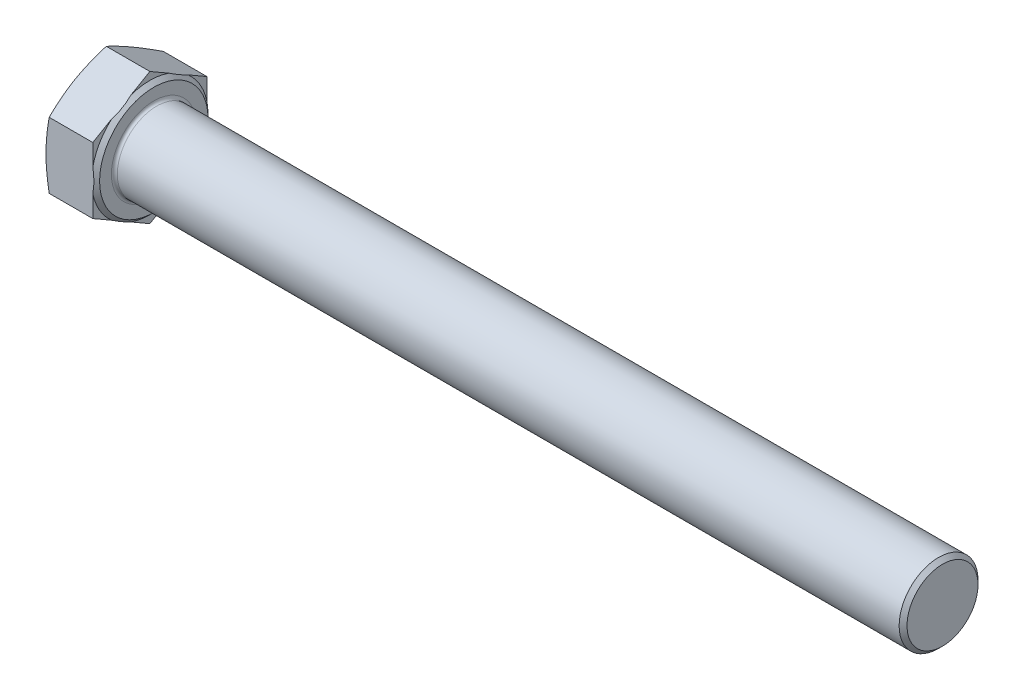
from build123d import *

# Parameters (mm, degrees)
BASEHEAD_DEPTH = 10.29
SKETCH5_R      = 8
BASEBODY_DEPTH = 160
CHAMFER1_SIZE  = 0.8
HEADFILLET_R   = 0.6


with BuildPart() as part:
    # Sketch2 → BaseHead (new body)
    with BuildSketch(Plane(origin=(0, 0, 0), x_dir=(0, 0, -1), z_dir=(1, 0, 0))):
        Polygon((11.58, -6.685716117), (11.58, 6.685716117), (0, 13.371432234), (-11.58, 6.685716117), (-11.58, -6.685716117), (0, -13.371432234), align=None)
    extrude(amount=BASEHEAD_DEPTH)

    # Sketch3 → BearingFace (revolve, cut)
    with BuildSketch(Plane.XY, mode=Mode.PRIVATE) as bearingface_sk:
        Polygon((10.29, 13.371432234), (10.29, 11), (9.49, 11.8), (9.49, 13.371432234), align=None)
    revolve(bearingface_sk.sketch.rotate(Axis((-0.957090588, 0, 0), (1, 0, 0)), 90), axis=Axis((-0.957090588, 0, 0), (1, 0, 0)), mode=Mode.SUBTRACT)

    # Sketch4 → HeadChamfer (revolve, cut)
    with BuildSketch(Plane.XY):
        Polygon((0, 13.371432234), (0.65202801, 13.371432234), (0, 11.58), align=None)
    revolve(axis=Axis((-0.493528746, 0, 0), (1, 0, 0)), mode=Mode.SUBTRACT)

    # Sketch5 → BaseBody (add)
    with BuildSketch(Plane(origin=(10.29, 0, 0), x_dir=(0, 0, -1), z_dir=(1, 0, 0))):
        with Locations(Location((0, 0, 0), (0, 0, 180))):
            Circle(SKETCH5_R)
    extrude(amount=BASEBODY_DEPTH)

    # Chamfer1
    chamfer1_edges = [part.edges().sort_by_distance(p)[0] for p in [
        (170.29, 0, -8),
    ]]
    chamfer(chamfer1_edges, length=CHAMFER1_SIZE)

    # HeadFillet
    headfillet_edges = [part.edges().sort_by_distance(p)[0] for p in [
        (10.29, 0, -8),
    ]]
    fillet(headfillet_edges, radius=HEADFILLET_R)


solid = part.part
